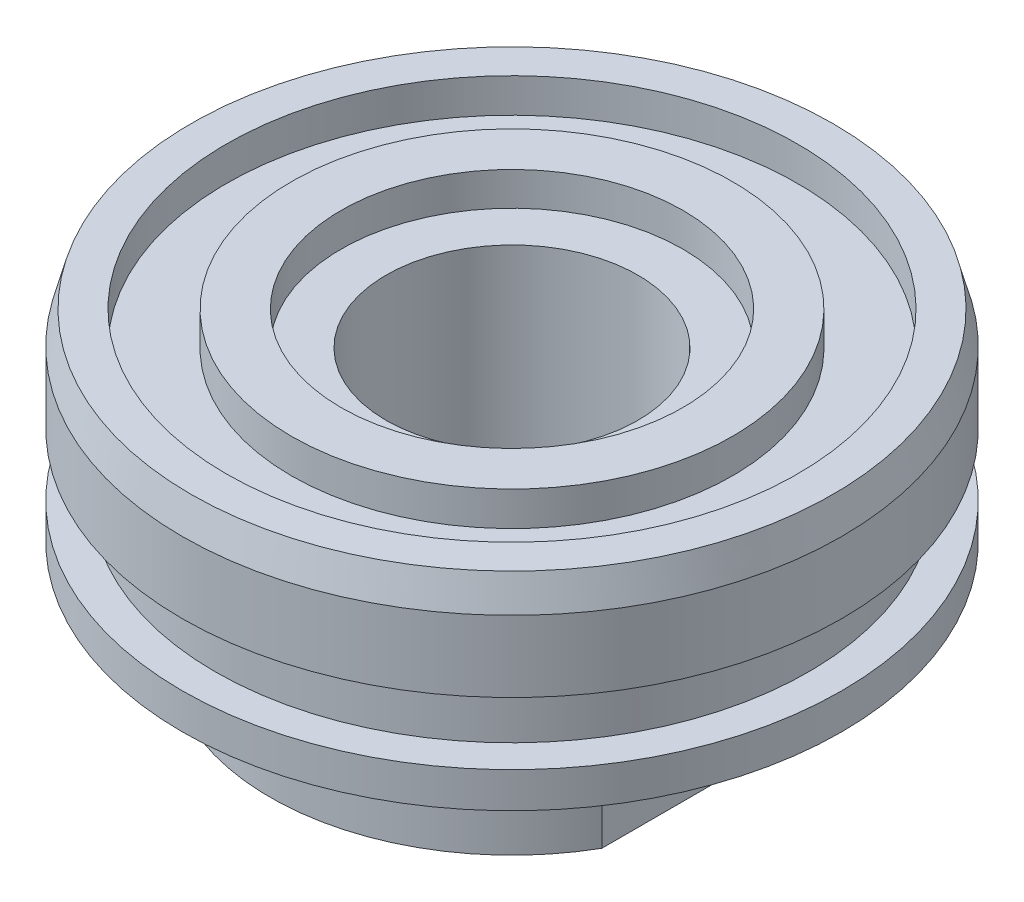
from build123d import *

# Parameters (mm, degrees)
SKETCH1_R          = 12.4714
SKETCH1_R_2        = 4.7625
EXTRUDE1_DEPTH     = 11.43
SKETCH2_R          = 10.8077
SKETCH2_R_2        = 8.3439
CUT_EXTRUDE1_DEPTH = 1.2954
SKETCH3_R          = 6.4643
CUT_EXTRUDE2_DEPTH = 1.27
CHAMFER1_SIZE      = 1.2192
CHAMFER1_SIZE2     = 0.326683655
SKETCH4_OUTSIDE_W  = 34.358
SKETCH4_OUTSIDE_H  = 34.358
CUT_EXTRUDE3_DEPTH = 3.81
SKETCH5_OUTSIDE_W  = 34.358
SKETCH5_OUTSIDE_H  = 34.358
SKETCH5_OUTSIDE_R  = 11.2268
CUT_EXTRUDE4_DEPTH = 2.3622


with BuildPart() as part:
    # Sketch1 → Extrude1 (new body)
    with BuildSketch(Plane(origin=(0, 0, 0), x_dir=(1, 0, 0), z_dir=(0, 1, 0))):
        with Locations(Location((0, 0, 0), (0, 0, 270))):
            Circle(SKETCH1_R)
        with Locations(Location((0, 0, 0), (0, 0, 270))):
            Circle(SKETCH1_R_2, mode=Mode.SUBTRACT)
    extrude(amount=EXTRUDE1_DEPTH)

    # Sketch2 → Cut-Extrude1 (cut)
    with BuildSketch(Plane(origin=(0, 11.43, 0), x_dir=(-1, 0, 0), z_dir=(0, 1, 0))):
        with Locations(Location((0, 0, 0), (0, 0, 90))):
            Circle(SKETCH2_R)
        with Locations(Location((0, 0, 0), (0, 0, 90))):
            Circle(SKETCH2_R_2, mode=Mode.SUBTRACT)
    extrude(amount=-CUT_EXTRUDE1_DEPTH, mode=Mode.SUBTRACT)

    # Sketch3 → Cut-Extrude2 (cut)
    with BuildSketch(Plane(origin=(0, 11.43, 0), x_dir=(-1, 0, 0), z_dir=(0, 1, 0))):
        with Locations(Location((0, 0, 0), (0, 0, 90))):
            Circle(SKETCH3_R)
    extrude(amount=-CUT_EXTRUDE2_DEPTH, mode=Mode.SUBTRACT)

    # Chamfer1
    chamfer1_edges = [part.edges().sort_by_distance(p)[0] for p in [
        (0, 11.43, -12.4714),
    ]]
    chamfer1_side = [part.faces().sort_by_distance(p)[0] for p in [
        (0, 5.715, -12.4714),
    ]]
    chamfer(chamfer1_edges, length=CHAMFER1_SIZE, length2=CHAMFER1_SIZE2, reference=chamfer1_side[0])

    # Sketch4 outside → Cut-Extrude3 (cut)
    with BuildSketch(Plane.XZ):
        Rectangle(SKETCH4_OUTSIDE_W, SKETCH4_OUTSIDE_H)
        with BuildLine():
            Line((7.9375, 0), (7.9375, -4.539694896))
            ThreePointArc((7.9375, -4.539694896), (0, -9.144), (-7.9375, -4.539694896))
            Line((-7.9375, -4.539694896), (-7.9375, 0))
            Line((-7.9375, 0), (-7.9375, 4.539694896))
            ThreePointArc((-7.9375, 4.539694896), (0, 9.144), (7.9375, 4.539694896))
            Line((7.9375, 4.539694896), (7.9375, 0))
        make_face(mode=Mode.SUBTRACT)
    extrude(amount=-CUT_EXTRUDE3_DEPTH, mode=Mode.SUBTRACT)

    # Sketch5 outside → Cut-Extrude4 (cut)
    with BuildSketch(Plane(origin=(0, 7.5184, 0), x_dir=(-1, 0, 0), z_dir=(0, 1, 0))):
        Rectangle(SKETCH5_OUTSIDE_W, SKETCH5_OUTSIDE_H)
        with Locations(Location((0, 0, 0), (0, 0, 90))):
            Circle(SKETCH5_OUTSIDE_R, mode=Mode.SUBTRACT)
    extrude(amount=-CUT_EXTRUDE4_DEPTH, mode=Mode.SUBTRACT)


solid = part.part
